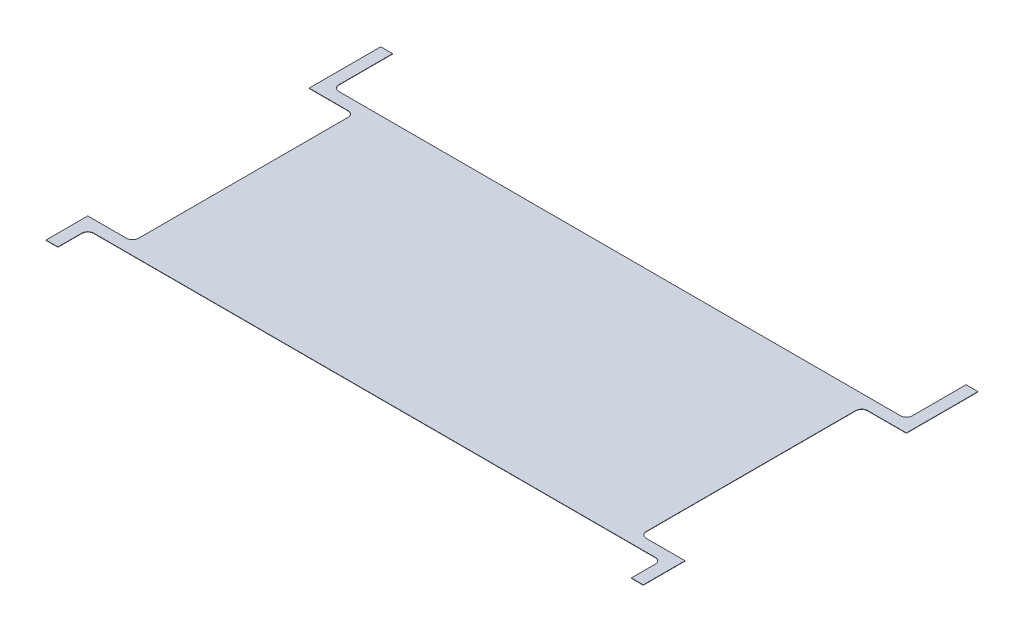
from build123d import *

# Parameters (mm, degrees)
BOSS_EXTRUDE1_DEPTH = 0.05


with BuildPart() as part:
    # Sketch1 → Boss-Extrude1 (new body)
    with BuildSketch(Plane(origin=(0, 0, 0), x_dir=(1, 0, 0), z_dir=(0, 1, 0))):
        with BuildLine():
            Line((0, 0), (2, 0))
            Line((2, 0), (2, 4))
            ThreePointArc((2, 4), (2.292893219, 4.707106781), (3, 5))
            Line((3, 5), (97.1, 5))
            ThreePointArc((97.1, 5), (97.807106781, 4.707106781), (98.1, 4))
            Line((98.1, 4), (98.1, 0))
            Line((98.1, 0), (100.1, 0))
            Line((100.1, 0), (100.1, 7))
            Line((100.1, 7), (93.6, 7))
            ThreePointArc((93.6, 7), (92.892893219, 7.292893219), (92.6, 8))
            Line((92.6, 8), (92.6, 43.1))
            ThreePointArc((92.6, 43.1), (92.892893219, 43.807106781), (93.6, 44.1))
            Line((93.6, 44.1), (100.1, 44.1))
            Line((100.1, 44.1), (100.1, 56.1))
            Line((100.1, 56.1), (98.1, 56.1))
            Line((98.1, 56.1), (98.1, 47.1))
            ThreePointArc((98.1, 47.1), (97.807106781, 46.392893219), (97.1, 46.1))
            Line((97.1, 46.1), (3, 46.1))
            ThreePointArc((3, 46.1), (2.292893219, 46.392893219), (2, 47.1))
            Line((2, 47.1), (2, 56.1))
            Line((2, 56.1), (0, 56.1))
            Line((0, 56.1), (0, 44.1))
            Line((0, 44.1), (6.5, 44.1))
            ThreePointArc((6.5, 44.1), (7.207106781, 43.807106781), (7.5, 43.1))
            Line((7.5, 43.1), (7.5, 8))
            ThreePointArc((7.5, 8), (7.207106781, 7.292893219), (6.5, 7))
            Line((6.5, 7), (0, 7))
            Line((0, 7), (0, 0))
        make_face()
    extrude(amount=BOSS_EXTRUDE1_DEPTH)


solid = part.part
